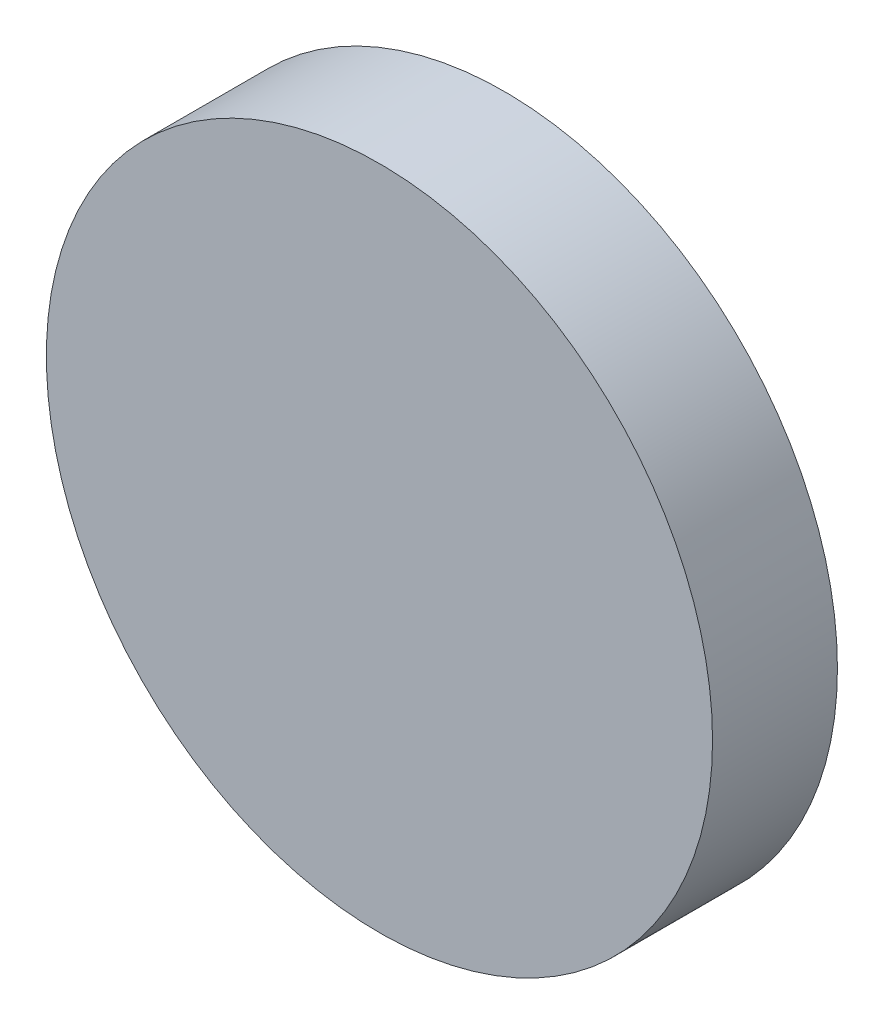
from build123d import *

# Parameters (mm, degrees)
SKETCH1_R           = 25.4
BOSS_EXTRUDE1_DEPTH = 9.525


with BuildPart() as part:
    # Sketch1 → Boss-Extrude1 (new body)
    with BuildSketch(Plane.XY):
        Circle(SKETCH1_R)
    extrude(amount=BOSS_EXTRUDE1_DEPTH)


solid = part.part
